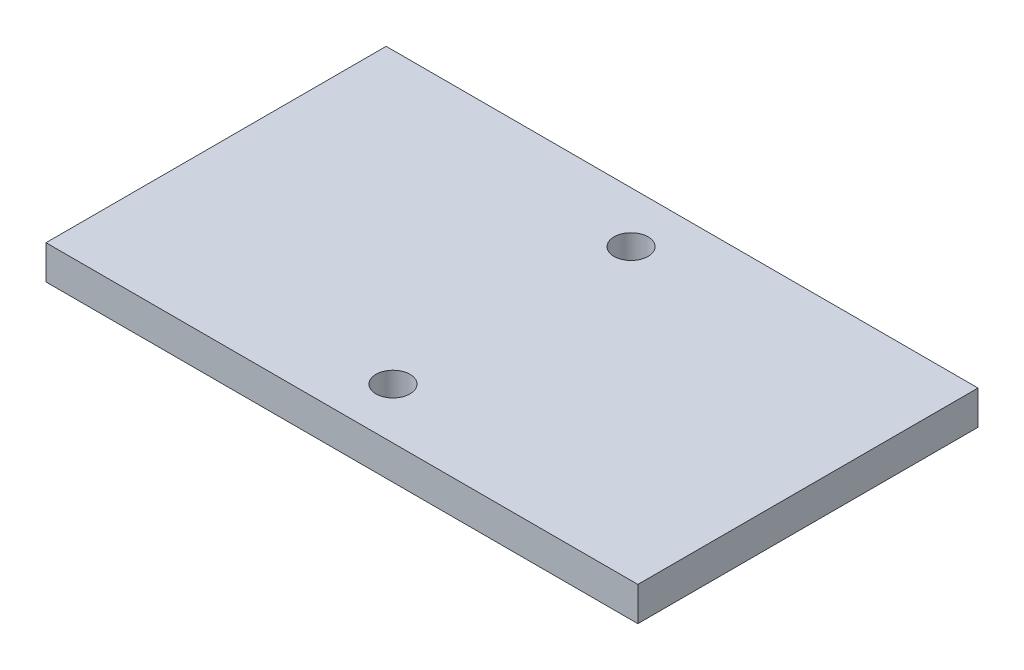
ISO-10303-21;
HEADER;
FILE_DESCRIPTION(('STEP AP214'),'2;1');
FILE_NAME('part.step','',(''),(''),'','','');
FILE_SCHEMA(('AUTOMOTIVE_DESIGN { 1 0 10303 214 1 1 1 1 }'));
ENDSEC;
DATA;
#1=APPLICATION_CONTEXT('core data for automotive mechanical design processes');
#2=APPLICATION_PROTOCOL_DEFINITION('international standard','automotive_design',2000,#1);
#3=PRODUCT_CONTEXT('',#1,'mechanical');
#4=PRODUCT('Part','Part','',(#3));
#5=PRODUCT_RELATED_PRODUCT_CATEGORY('part','',(#4));
#6=PRODUCT_DEFINITION_FORMATION('','',#4);
#7=PRODUCT_DEFINITION_CONTEXT('part definition',#1,'design');
#8=PRODUCT_DEFINITION('design','',#6,#7);
#9=PRODUCT_DEFINITION_SHAPE('','',#8);
#10=(LENGTH_UNIT() NAMED_UNIT(*) SI_UNIT(.MILLI.,.METRE.));
#11=(NAMED_UNIT(*) PLANE_ANGLE_UNIT() SI_UNIT($,.RADIAN.));
#12=(NAMED_UNIT(*) SI_UNIT($,.STERADIAN.) SOLID_ANGLE_UNIT());
#13=UNCERTAINTY_MEASURE_WITH_UNIT(LENGTH_MEASURE(1.E-05),#10,'distance_accuracy_value','');
#14=(GEOMETRIC_REPRESENTATION_CONTEXT(3) GLOBAL_UNCERTAINTY_ASSIGNED_CONTEXT((#13)) GLOBAL_UNIT_ASSIGNED_CONTEXT((#10,
#11,#12)) REPRESENTATION_CONTEXT('',''));
#15=CARTESIAN_POINT('',(0.,0.,0.));
#16=DIRECTION('',(0.,0.,1.));
#17=DIRECTION('',(1.,0.,0.));
#18=AXIS2_PLACEMENT_3D('',#15,#16,#17);
#19=CARTESIAN_POINT('',(8.7,1.,5.));
#20=DIRECTION('',(-1.,0.,0.));
#21=DIRECTION('',(0.,0.,1.));
#22=AXIS2_PLACEMENT_3D('',#19,#20,#21);
#23=PLANE('',#22);
#24=DIRECTION('',(0.,0.,-1.));
#25=VECTOR('',#24,1.);
#26=CARTESIAN_POINT('',(8.7,0.,5.));
#27=LINE('',#26,#25);
#28=CARTESIAN_POINT('',(8.7,0.,5.));
#29=VERTEX_POINT('',#28);
#30=CARTESIAN_POINT('',(8.7,0.,-5.));
#31=VERTEX_POINT('',#30);
#32=EDGE_CURVE('E102',#29,#31,#27,.T.);
#33=ORIENTED_EDGE('',*,*,#32,.T.);
#34=DIRECTION('',(0.,-1.,0.));
#35=VECTOR('',#34,1.);
#36=CARTESIAN_POINT('',(8.7,1.,-5.));
#37=LINE('',#36,#35);
#38=CARTESIAN_POINT('',(8.7,1.,-5.));
#39=VERTEX_POINT('',#38);
#40=EDGE_CURVE('E11',#39,#31,#37,.T.);
#41=ORIENTED_EDGE('',*,*,#40,.F.);
#42=DIRECTION('',(0.,0.,-1.));
#43=VECTOR('',#42,1.);
#44=CARTESIAN_POINT('',(8.7,1.,5.));
#45=LINE('',#44,#43);
#46=CARTESIAN_POINT('',(8.7,1.,5.));
#47=VERTEX_POINT('',#46);
#48=EDGE_CURVE('E90',#47,#39,#45,.T.);
#49=ORIENTED_EDGE('',*,*,#48,.F.);
#50=DIRECTION('',(0.,-1.,0.));
#51=VECTOR('',#50,1.);
#52=CARTESIAN_POINT('',(8.7,1.,5.));
#53=LINE('',#52,#51);
#54=EDGE_CURVE('E98',#47,#29,#53,.T.);
#55=ORIENTED_EDGE('',*,*,#54,.T.);
#56=EDGE_LOOP('',(#33,#41,#49,#55));
#57=FACE_BOUND('',#56,.T.);
#58=ADVANCED_FACE('F39',(#57),#23,.F.);
#59=CARTESIAN_POINT('',(-8.7,1.,-5.));
#60=DIRECTION('',(0.,0.,1.));
#61=DIRECTION('',(1.,0.,0.));
#62=AXIS2_PLACEMENT_3D('',#59,#60,#61);
#63=PLANE('',#62);
#64=DIRECTION('',(-1.,0.,0.));
#65=VECTOR('',#64,1.);
#66=CARTESIAN_POINT('',(-8.7,0.,-5.));
#67=LINE('',#66,#65);
#68=CARTESIAN_POINT('',(-8.7,0.,-5.));
#69=VERTEX_POINT('',#68);
#70=EDGE_CURVE('E94',#31,#69,#67,.T.);
#71=ORIENTED_EDGE('',*,*,#70,.T.);
#72=DIRECTION('',(0.,-1.,0.));
#73=VECTOR('',#72,1.);
#74=CARTESIAN_POINT('',(-8.7,1.,-5.));
#75=LINE('',#74,#73);
#76=CARTESIAN_POINT('',(-8.7,1.,-5.));
#77=VERTEX_POINT('',#76);
#78=EDGE_CURVE('E47',#77,#69,#75,.T.);
#79=ORIENTED_EDGE('',*,*,#78,.F.);
#80=DIRECTION('',(-1.,0.,0.));
#81=VECTOR('',#80,1.);
#82=CARTESIAN_POINT('',(-8.7,1.,-5.));
#83=LINE('',#82,#81);
#84=EDGE_CURVE('E85',#39,#77,#83,.T.);
#85=ORIENTED_EDGE('',*,*,#84,.F.);
#86=ORIENTED_EDGE('',*,*,#40,.T.);
#87=EDGE_LOOP('',(#71,#79,#85,#86));
#88=FACE_BOUND('',#87,.T.);
#89=ADVANCED_FACE('F93',(#88),#63,.F.);
#90=CARTESIAN_POINT('',(-8.7,1.,5.));
#91=DIRECTION('',(1.,0.,0.));
#92=DIRECTION('',(0.,0.,-1.));
#93=AXIS2_PLACEMENT_3D('',#90,#91,#92);
#94=PLANE('',#93);
#95=DIRECTION('',(0.,0.,1.));
#96=VECTOR('',#95,1.);
#97=CARTESIAN_POINT('',(-8.7,0.,5.));
#98=LINE('',#97,#96);
#99=CARTESIAN_POINT('',(-8.7,0.,5.));
#100=VERTEX_POINT('',#99);
#101=EDGE_CURVE('E72',#69,#100,#98,.T.);
#102=ORIENTED_EDGE('',*,*,#101,.T.);
#103=DIRECTION('',(0.,-1.,0.));
#104=VECTOR('',#103,1.);
#105=CARTESIAN_POINT('',(-8.7,1.,5.));
#106=LINE('',#105,#104);
#107=CARTESIAN_POINT('',(-8.7,1.,5.));
#108=VERTEX_POINT('',#107);
#109=EDGE_CURVE('E95',#108,#100,#106,.T.);
#110=ORIENTED_EDGE('',*,*,#109,.F.);
#111=DIRECTION('',(0.,0.,1.));
#112=VECTOR('',#111,1.);
#113=CARTESIAN_POINT('',(-8.7,1.,5.));
#114=LINE('',#113,#112);
#115=EDGE_CURVE('E88',#77,#108,#114,.T.);
#116=ORIENTED_EDGE('',*,*,#115,.F.);
#117=ORIENTED_EDGE('',*,*,#78,.T.);
#118=EDGE_LOOP('',(#102,#110,#116,#117));
#119=FACE_BOUND('',#118,.T.);
#120=ADVANCED_FACE('F96',(#119),#94,.F.);
#121=CARTESIAN_POINT('',(-8.7,1.,5.));
#122=DIRECTION('',(0.,0.,-1.));
#123=DIRECTION('',(-1.,0.,0.));
#124=AXIS2_PLACEMENT_3D('',#121,#122,#123);
#125=PLANE('',#124);
#126=DIRECTION('',(1.,0.,0.));
#127=VECTOR('',#126,1.);
#128=CARTESIAN_POINT('',(-8.7,0.,5.));
#129=LINE('',#128,#127);
#130=EDGE_CURVE('E78',#100,#29,#129,.T.);
#131=ORIENTED_EDGE('',*,*,#130,.T.);
#132=ORIENTED_EDGE('',*,*,#54,.F.);
#133=DIRECTION('',(1.,0.,0.));
#134=VECTOR('',#133,1.);
#135=CARTESIAN_POINT('',(-8.7,1.,5.));
#136=LINE('',#135,#134);
#137=EDGE_CURVE('E55',#108,#47,#136,.T.);
#138=ORIENTED_EDGE('',*,*,#137,.F.);
#139=ORIENTED_EDGE('',*,*,#109,.T.);
#140=EDGE_LOOP('',(#131,#132,#138,#139));
#141=FACE_BOUND('',#140,.T.);
#142=ADVANCED_FACE('F110',(#141),#125,.F.);
#143=CARTESIAN_POINT('',(0.,1.,0.));
#144=DIRECTION('',(0.,-1.,0.));
#145=DIRECTION('',(0.,0.,-1.));
#146=AXIS2_PLACEMENT_3D('',#143,#144,#145);
#147=PLANE('',#146);
#148=CARTESIAN_POINT('',(0.,1.,-3.50000000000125));
#149=DIRECTION('',(0.,1.,0.));
#150=DIRECTION('',(0.,0.,1.));
#151=AXIS2_PLACEMENT_3D('',#148,#149,#150);
#152=CIRCLE('',#151,0.5);
#153=CARTESIAN_POINT('',(0.,1.,-3.00000000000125));
#154=VERTEX_POINT('',#153);
#155=EDGE_CURVE('E122',#154,#154,#152,.T.);
#156=ORIENTED_EDGE('',*,*,#155,.F.);
#157=EDGE_LOOP('',(#156));
#158=FACE_BOUND('',#157,.T.);
#159=CARTESIAN_POINT('',(0.,1.,3.50000000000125));
#160=DIRECTION('',(0.,1.,0.));
#161=DIRECTION('',(0.,0.,1.));
#162=AXIS2_PLACEMENT_3D('',#159,#160,#161);
#163=CIRCLE('',#162,0.5);
#164=CARTESIAN_POINT('',(0.,1.,4.00000000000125));
#165=VERTEX_POINT('',#164);
#166=EDGE_CURVE('E119',#165,#165,#163,.T.);
#167=ORIENTED_EDGE('',*,*,#166,.F.);
#168=EDGE_LOOP('',(#167));
#169=FACE_BOUND('',#168,.T.);
#170=ORIENTED_EDGE('',*,*,#48,.T.);
#171=ORIENTED_EDGE('',*,*,#84,.T.);
#172=ORIENTED_EDGE('',*,*,#115,.T.);
#173=ORIENTED_EDGE('',*,*,#137,.T.);
#174=EDGE_LOOP('',(#170,#171,#172,#173));
#175=FACE_BOUND('',#174,.T.);
#176=ADVANCED_FACE('F86',(#158,#169,#175),#147,.F.);
#177=CARTESIAN_POINT('',(0.,0.,0.));
#178=DIRECTION('',(0.,-1.,0.));
#179=DIRECTION('',(0.,0.,-1.));
#180=AXIS2_PLACEMENT_3D('',#177,#178,#179);
#181=PLANE('',#180);
#182=CARTESIAN_POINT('',(0.,0.,-3.50000000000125));
#183=DIRECTION('',(0.,1.,0.));
#184=DIRECTION('',(0.,0.,1.));
#185=AXIS2_PLACEMENT_3D('',#182,#183,#184);
#186=CIRCLE('',#185,0.5);
#187=CARTESIAN_POINT('',(0.,0.,-3.00000000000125));
#188=VERTEX_POINT('',#187);
#189=EDGE_CURVE('E105',#188,#188,#186,.T.);
#190=ORIENTED_EDGE('',*,*,#189,.T.);
#191=EDGE_LOOP('',(#190));
#192=FACE_BOUND('',#191,.T.);
#193=CARTESIAN_POINT('',(0.,0.,3.50000000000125));
#194=DIRECTION('',(0.,1.,0.));
#195=DIRECTION('',(0.,0.,1.));
#196=AXIS2_PLACEMENT_3D('',#193,#194,#195);
#197=CIRCLE('',#196,0.5);
#198=CARTESIAN_POINT('',(0.,0.,4.00000000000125));
#199=VERTEX_POINT('',#198);
#200=EDGE_CURVE('E116',#199,#199,#197,.T.);
#201=ORIENTED_EDGE('',*,*,#200,.T.);
#202=EDGE_LOOP('',(#201));
#203=FACE_BOUND('',#202,.T.);
#204=ORIENTED_EDGE('',*,*,#32,.F.);
#205=ORIENTED_EDGE('',*,*,#130,.F.);
#206=ORIENTED_EDGE('',*,*,#101,.F.);
#207=ORIENTED_EDGE('',*,*,#70,.F.);
#208=EDGE_LOOP('',(#204,#205,#206,#207));
#209=FACE_BOUND('',#208,.T.);
#210=ADVANCED_FACE('F113',(#192,#203,#209),#181,.T.);
#211=CARTESIAN_POINT('',(0.,0.,3.50000000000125));
#212=DIRECTION('',(0.,1.,0.));
#213=DIRECTION('',(0.,0.,1.));
#214=AXIS2_PLACEMENT_3D('',#211,#212,#213);
#215=CYLINDRICAL_SURFACE('',#214,0.5);
#216=ORIENTED_EDGE('',*,*,#200,.F.);
#217=EDGE_LOOP('',(#216));
#218=FACE_BOUND('',#217,.T.);
#219=ORIENTED_EDGE('',*,*,#166,.T.);
#220=EDGE_LOOP('',(#219));
#221=FACE_BOUND('',#220,.T.);
#222=ADVANCED_FACE('F133',(#218,#221),#215,.F.);
#223=CARTESIAN_POINT('',(0.,0.,-3.50000000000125));
#224=DIRECTION('',(0.,1.,0.));
#225=DIRECTION('',(0.,0.,1.));
#226=AXIS2_PLACEMENT_3D('',#223,#224,#225);
#227=CYLINDRICAL_SURFACE('',#226,0.5);
#228=ORIENTED_EDGE('',*,*,#189,.F.);
#229=EDGE_LOOP('',(#228));
#230=FACE_BOUND('',#229,.T.);
#231=ORIENTED_EDGE('',*,*,#155,.T.);
#232=EDGE_LOOP('',(#231));
#233=FACE_BOUND('',#232,.T.);
#234=ADVANCED_FACE('F130',(#230,#233),#227,.F.);
#235=CLOSED_SHELL('',(#58,#89,#120,#142,#176,#210,#222,#234));
#236=MANIFOLD_SOLID_BREP('B2',#235);
#237=ADVANCED_BREP_SHAPE_REPRESENTATION('',(#18,#236),#14);
#238=SHAPE_DEFINITION_REPRESENTATION(#9,#237);
ENDSEC;
END-ISO-10303-21;
